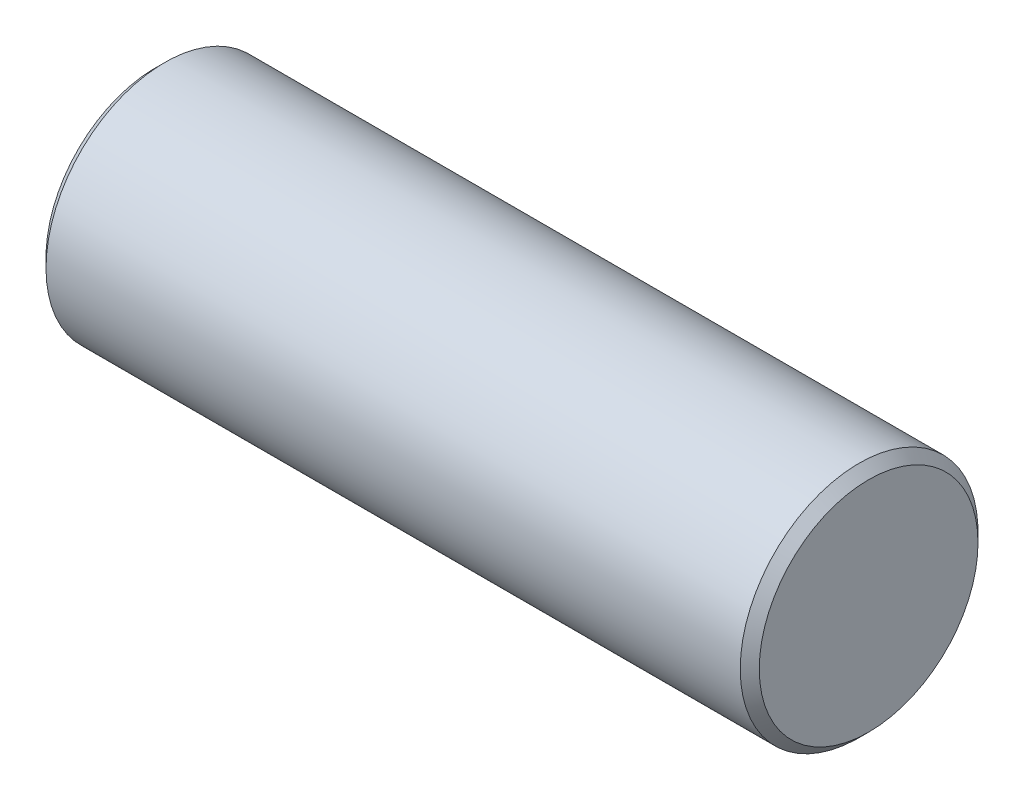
ISO-10303-21;
HEADER;
FILE_DESCRIPTION(('STEP AP214'),'2;1');
FILE_NAME('part.step','',(''),(''),'','','');
FILE_SCHEMA(('AUTOMOTIVE_DESIGN { 1 0 10303 214 1 1 1 1 }'));
ENDSEC;
DATA;
#1=APPLICATION_CONTEXT('core data for automotive mechanical design processes');
#2=APPLICATION_PROTOCOL_DEFINITION('international standard','automotive_design',2000,#1);
#3=PRODUCT_CONTEXT('',#1,'mechanical');
#4=PRODUCT('Part','Part','',(#3));
#5=PRODUCT_RELATED_PRODUCT_CATEGORY('part','',(#4));
#6=PRODUCT_DEFINITION_FORMATION('','',#4);
#7=PRODUCT_DEFINITION_CONTEXT('part definition',#1,'design');
#8=PRODUCT_DEFINITION('design','',#6,#7);
#9=PRODUCT_DEFINITION_SHAPE('','',#8);
#10=(LENGTH_UNIT() NAMED_UNIT(*) SI_UNIT(.MILLI.,.METRE.));
#11=(NAMED_UNIT(*) PLANE_ANGLE_UNIT() SI_UNIT($,.RADIAN.));
#12=(NAMED_UNIT(*) SI_UNIT($,.STERADIAN.) SOLID_ANGLE_UNIT());
#13=UNCERTAINTY_MEASURE_WITH_UNIT(LENGTH_MEASURE(1.E-05),#10,'distance_accuracy_value','');
#14=(GEOMETRIC_REPRESENTATION_CONTEXT(3) GLOBAL_UNCERTAINTY_ASSIGNED_CONTEXT((#13)) GLOBAL_UNIT_ASSIGNED_CONTEXT((#10,
#11,#12)) REPRESENTATION_CONTEXT('',''));
#15=CARTESIAN_POINT('',(0.,0.,0.));
#16=DIRECTION('',(0.,0.,1.));
#17=DIRECTION('',(1.,0.,0.));
#18=AXIS2_PLACEMENT_3D('',#15,#16,#17);
#19=CARTESIAN_POINT('',(19.05,0.,0.));
#20=DIRECTION('',(-1.,0.,0.));
#21=DIRECTION('',(0.,0.,1.));
#22=AXIS2_PLACEMENT_3D('',#19,#20,#21);
#23=CYLINDRICAL_SURFACE('',#22,3.175);
#24=CARTESIAN_POINT('',(18.796,0.,0.));
#25=DIRECTION('',(1.,0.,0.));
#26=DIRECTION('',(0.,0.,-1.));
#27=AXIS2_PLACEMENT_3D('',#24,#25,#26);
#28=CIRCLE('',#27,3.175);
#29=CARTESIAN_POINT('',(18.796,0.,3.175));
#30=VERTEX_POINT('',#29);
#31=EDGE_CURVE('E38',#30,#30,#28,.F.);
#32=CARTESIAN_POINT('',(0.254000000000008,0.,0.));
#33=DIRECTION('',(1.,0.,0.));
#34=DIRECTION('',(0.,0.,-1.));
#35=AXIS2_PLACEMENT_3D('',#32,#33,#34);
#36=CIRCLE('',#35,3.175);
#37=CARTESIAN_POINT('',(0.254000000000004,0.,3.175));
#38=VERTEX_POINT('',#37);
#39=EDGE_CURVE('E42',#38,#38,#36,.T.);
#40=CARTESIAN_POINT('',(18.796,0.,3.175));
#41=CARTESIAN_POINT('',(18.6028541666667,0.,3.175));
#42=CARTESIAN_POINT('',(18.4097083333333,0.,3.175));
#43=CARTESIAN_POINT('',(18.0234166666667,0.,3.175));
#44=CARTESIAN_POINT('',(17.8302708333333,0.,3.175));
#45=CARTESIAN_POINT('',(17.4439791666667,0.,3.175));
#46=CARTESIAN_POINT('',(17.2508333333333,0.,3.175));
#47=CARTESIAN_POINT('',(16.8645416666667,0.,3.175));
#48=CARTESIAN_POINT('',(16.6713958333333,0.,3.175));
#49=CARTESIAN_POINT('',(16.2851041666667,0.,3.175));
#50=CARTESIAN_POINT('',(16.0919583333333,0.,3.175));
#51=CARTESIAN_POINT('',(15.7056666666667,0.,3.175));
#52=CARTESIAN_POINT('',(15.5125208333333,0.,3.175));
#53=CARTESIAN_POINT('',(15.1262291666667,0.,3.175));
#54=CARTESIAN_POINT('',(14.9330833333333,0.,3.175));
#55=CARTESIAN_POINT('',(14.5467916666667,0.,3.175));
#56=CARTESIAN_POINT('',(14.3536458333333,0.,3.175));
#57=CARTESIAN_POINT('',(13.9673541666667,0.,3.175));
#58=CARTESIAN_POINT('',(13.7742083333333,0.,3.175));
#59=CARTESIAN_POINT('',(13.3879166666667,0.,3.175));
#60=CARTESIAN_POINT('',(13.1947708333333,0.,3.175));
#61=CARTESIAN_POINT('',(12.8084791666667,0.,3.175));
#62=CARTESIAN_POINT('',(12.6153333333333,0.,3.175));
#63=CARTESIAN_POINT('',(12.2290416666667,0.,3.175));
#64=CARTESIAN_POINT('',(12.0358958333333,0.,3.175));
#65=CARTESIAN_POINT('',(11.6496041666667,0.,3.175));
#66=CARTESIAN_POINT('',(11.4564583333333,0.,3.175));
#67=CARTESIAN_POINT('',(11.0701666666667,0.,3.175));
#68=CARTESIAN_POINT('',(10.8770208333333,0.,3.175));
#69=CARTESIAN_POINT('',(10.4907291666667,0.,3.175));
#70=CARTESIAN_POINT('',(10.2975833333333,0.,3.175));
#71=CARTESIAN_POINT('',(9.91129166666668,0.,3.175));
#72=CARTESIAN_POINT('',(9.71814583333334,0.,3.175));
#73=CARTESIAN_POINT('',(9.33185416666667,0.,3.175));
#74=CARTESIAN_POINT('',(9.13870833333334,0.,3.175));
#75=CARTESIAN_POINT('',(8.75241666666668,0.,3.175));
#76=CARTESIAN_POINT('',(8.55927083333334,0.,3.175));
#77=CARTESIAN_POINT('',(8.17297916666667,0.,3.175));
#78=CARTESIAN_POINT('',(7.97983333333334,0.,3.175));
#79=CARTESIAN_POINT('',(7.59354166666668,0.,3.175));
#80=CARTESIAN_POINT('',(7.40039583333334,0.,3.175));
#81=CARTESIAN_POINT('',(7.01410416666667,0.,3.175));
#82=CARTESIAN_POINT('',(6.82095833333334,0.,3.175));
#83=CARTESIAN_POINT('',(6.43466666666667,0.,3.175));
#84=CARTESIAN_POINT('',(6.24152083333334,0.,3.175));
#85=CARTESIAN_POINT('',(5.85522916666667,0.,3.175));
#86=CARTESIAN_POINT('',(5.66208333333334,0.,3.175));
#87=CARTESIAN_POINT('',(5.27579166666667,0.,3.175));
#88=CARTESIAN_POINT('',(5.08264583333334,0.,3.175));
#89=CARTESIAN_POINT('',(4.69635416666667,0.,3.175));
#90=CARTESIAN_POINT('',(4.50320833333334,0.,3.175));
#91=CARTESIAN_POINT('',(4.11691666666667,0.,3.175));
#92=CARTESIAN_POINT('',(3.92377083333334,0.,3.175));
#93=CARTESIAN_POINT('',(3.53747916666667,0.,3.175));
#94=CARTESIAN_POINT('',(3.34433333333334,0.,3.175));
#95=CARTESIAN_POINT('',(2.95804166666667,0.,3.175));
#96=CARTESIAN_POINT('',(2.76489583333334,0.,3.175));
#97=CARTESIAN_POINT('',(2.37860416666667,0.,3.175));
#98=CARTESIAN_POINT('',(2.18545833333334,0.,3.175));
#99=CARTESIAN_POINT('',(1.79916666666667,0.,3.175));
#100=CARTESIAN_POINT('',(1.60602083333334,0.,3.175));
#101=CARTESIAN_POINT('',(1.21972916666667,0.,3.175));
#102=CARTESIAN_POINT('',(1.02658333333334,0.,3.175));
#103=CARTESIAN_POINT('',(0.640291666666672,0.,3.175));
#104=CARTESIAN_POINT('',(0.447145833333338,0.,3.175));
#105=CARTESIAN_POINT('',(0.254000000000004,0.,3.175));
#106=B_SPLINE_CURVE_WITH_KNOTS('',3,(#40,#41,#42,#43,#44,#45,#46,#47,#48,#49,#50,#51,#52,#53,
#54,#55,#56,#57,#58,#59,#60,#61,#62,#63,#64,#65,#66,#67,#68,#69,#70,#71,#72,#73,#74,#75,#76,#77,
#78,#79,#80,#81,#82,#83,#84,#85,#86,#87,#88,#89,#90,#91,#92,#93,#94,#95,#96,#97,#98,#99,#100,
#101,#102,#103,#104,#105),.UNSPECIFIED.,.F.,.F.,(4,2,2,2,2,2,2,2,2,2,2,2,2,2,2,2,2,2,2,2,2,2,2,
2,2,2,2,2,2,2,2,2,4),(0.,0.579437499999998,1.158875,1.7383125,2.31775,2.8971875,3.476625,
4.0560625,4.6355,5.2149375,5.794375,6.3738125,6.95325,7.5326875,8.112125,8.6915625,9.271,
9.8504375,10.429875,11.0093125,11.58875,12.1681875,12.747625,13.3270625,13.9065,14.4859375,
15.065375,15.6448125,16.22425,16.8036875,17.383125,17.9625625,18.542),.UNSPECIFIED.);
#107=EDGE_CURVE('BSEAM31',#30,#38,#106,.T.);
#108=ORIENTED_EDGE('',*,*,#31,.T.);
#109=ORIENTED_EDGE('',*,*,#39,.T.);
#110=ORIENTED_EDGE('',*,*,#107,.T.);
#111=ORIENTED_EDGE('',*,*,#107,.F.);
#112=EDGE_LOOP('',(#108,#110,#109,#111));
#113=FACE_BOUND('',#112,.T.);
#114=ADVANCED_FACE('F31',(#113),#23,.T.);
#115=CARTESIAN_POINT('',(19.05,0.,0.));
#116=DIRECTION('',(1.,0.,0.));
#117=DIRECTION('',(0.,0.,-1.));
#118=AXIS2_PLACEMENT_3D('',#115,#116,#117);
#119=PLANE('',#118);
#120=CARTESIAN_POINT('',(19.05,0.,0.));
#121=DIRECTION('',(1.,0.,0.));
#122=DIRECTION('',(0.,0.,-1.));
#123=AXIS2_PLACEMENT_3D('',#120,#121,#122);
#124=CIRCLE('',#123,2.92100000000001);
#125=CARTESIAN_POINT('',(19.05,0.,-2.92100000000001));
#126=VERTEX_POINT('',#125);
#127=EDGE_CURVE('E46',#126,#126,#124,.T.);
#128=ORIENTED_EDGE('',*,*,#127,.T.);
#129=EDGE_LOOP('',(#128));
#130=FACE_BOUND('',#129,.T.);
#131=ADVANCED_FACE('F52',(#130),#119,.T.);
#132=CARTESIAN_POINT('',(0.,0.,0.));
#133=DIRECTION('',(1.,0.,0.));
#134=DIRECTION('',(0.,0.,-1.));
#135=AXIS2_PLACEMENT_3D('',#132,#133,#134);
#136=PLANE('',#135);
#137=CARTESIAN_POINT('',(0.,0.,0.));
#138=DIRECTION('',(1.,0.,0.));
#139=DIRECTION('',(0.,0.,-1.));
#140=AXIS2_PLACEMENT_3D('',#137,#138,#139);
#141=CIRCLE('',#140,2.92099999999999);
#142=CARTESIAN_POINT('',(0.,0.,-2.92099999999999));
#143=VERTEX_POINT('',#142);
#144=EDGE_CURVE('E10',#143,#143,#141,.F.);
#145=ORIENTED_EDGE('',*,*,#144,.T.);
#146=EDGE_LOOP('',(#145));
#147=FACE_BOUND('',#146,.T.);
#148=ADVANCED_FACE('F56',(#147),#136,.F.);
#149=CARTESIAN_POINT('',(19.05,0.,0.));
#150=DIRECTION('',(-1.,0.,0.));
#151=DIRECTION('',(0.,0.,1.));
#152=AXIS2_PLACEMENT_3D('',#149,#150,#151);
#153=CONICAL_SURFACE('',#152,2.92100000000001,0.785398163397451);
#154=ORIENTED_EDGE('',*,*,#31,.F.);
#155=EDGE_LOOP('',(#154));
#156=FACE_BOUND('',#155,.T.);
#157=ORIENTED_EDGE('',*,*,#127,.F.);
#158=EDGE_LOOP('',(#157));
#159=FACE_BOUND('',#158,.T.);
#160=ADVANCED_FACE('F54',(#156,#159),#153,.T.);
#161=CARTESIAN_POINT('',(0.254000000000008,0.,0.));
#162=DIRECTION('',(1.,0.,0.));
#163=DIRECTION('',(0.,0.,-1.));
#164=AXIS2_PLACEMENT_3D('',#161,#162,#163);
#165=CONICAL_SURFACE('',#164,3.175,0.785398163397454);
#166=ORIENTED_EDGE('',*,*,#144,.F.);
#167=EDGE_LOOP('',(#166));
#168=FACE_BOUND('',#167,.T.);
#169=ORIENTED_EDGE('',*,*,#39,.F.);
#170=EDGE_LOOP('',(#169));
#171=FACE_BOUND('',#170,.T.);
#172=ADVANCED_FACE('F33',(#168,#171),#165,.T.);
#173=CLOSED_SHELL('',(#114,#131,#148,#160,#172));
#174=MANIFOLD_SOLID_BREP('B2',#173);
#175=ADVANCED_BREP_SHAPE_REPRESENTATION('',(#18,#174),#14);
#176=SHAPE_DEFINITION_REPRESENTATION(#9,#175);
ENDSEC;
END-ISO-10303-21;
